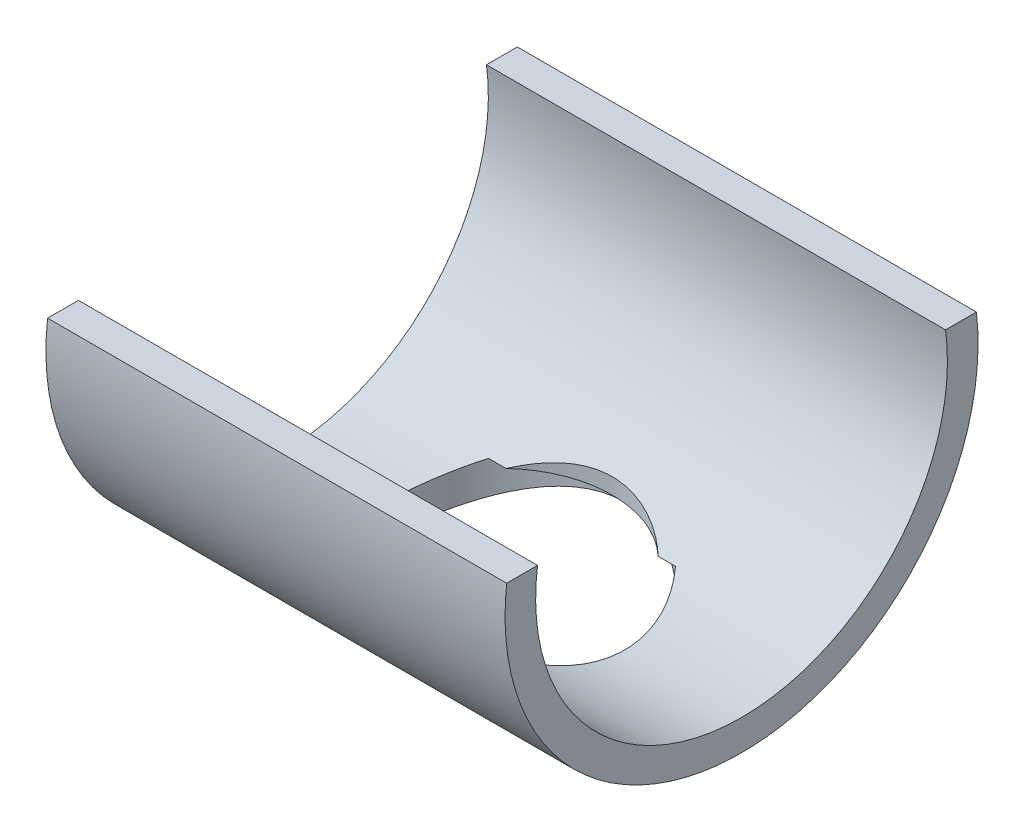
ISO-10303-21;
HEADER;
FILE_DESCRIPTION(('STEP AP214'),'2;1');
FILE_NAME('part.step','',(''),(''),'','','');
FILE_SCHEMA(('AUTOMOTIVE_DESIGN { 1 0 10303 214 1 1 1 1 }'));
ENDSEC;
DATA;
#1=APPLICATION_CONTEXT('core data for automotive mechanical design processes');
#2=APPLICATION_PROTOCOL_DEFINITION('international standard','automotive_design',2000,#1);
#3=PRODUCT_CONTEXT('',#1,'mechanical');
#4=PRODUCT('Part','Part','',(#3));
#5=PRODUCT_RELATED_PRODUCT_CATEGORY('part','',(#4));
#6=PRODUCT_DEFINITION_FORMATION('','',#4);
#7=PRODUCT_DEFINITION_CONTEXT('part definition',#1,'design');
#8=PRODUCT_DEFINITION('design','',#6,#7);
#9=PRODUCT_DEFINITION_SHAPE('','',#8);
#10=(LENGTH_UNIT() NAMED_UNIT(*) SI_UNIT(.MILLI.,.METRE.));
#11=(NAMED_UNIT(*) PLANE_ANGLE_UNIT() SI_UNIT($,.RADIAN.));
#12=(NAMED_UNIT(*) SI_UNIT($,.STERADIAN.) SOLID_ANGLE_UNIT());
#13=UNCERTAINTY_MEASURE_WITH_UNIT(LENGTH_MEASURE(1.E-05),#10,'distance_accuracy_value','');
#14=(GEOMETRIC_REPRESENTATION_CONTEXT(3) GLOBAL_UNCERTAINTY_ASSIGNED_CONTEXT((#13)) GLOBAL_UNIT_ASSIGNED_CONTEXT((#10,
#11,#12)) REPRESENTATION_CONTEXT('',''));
#15=CARTESIAN_POINT('',(0.,0.,0.));
#16=DIRECTION('',(0.,0.,1.));
#17=DIRECTION('',(1.,0.,0.));
#18=AXIS2_PLACEMENT_3D('',#15,#16,#17);
#19=CARTESIAN_POINT('',(-78.5,0.,0.));
#20=DIRECTION('',(1.,0.,0.));
#21=DIRECTION('',(0.,0.,-1.));
#22=AXIS2_PLACEMENT_3D('',#19,#20,#21);
#23=CYLINDRICAL_SURFACE('',#22,74.);
#24=DIRECTION('',(1.,0.,0.));
#25=VECTOR('',#24,1.);
#26=CARTESIAN_POINT('',(-78.5,10.,73.3212111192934));
#27=LINE('',#26,#25);
#28=CARTESIAN_POINT('',(-78.5,10.,73.3212111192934));
#29=VERTEX_POINT('',#28);
#30=CARTESIAN_POINT('',(86.5,10.,73.3212111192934));
#31=VERTEX_POINT('',#30);
#32=EDGE_CURVE('E186',#29,#31,#27,.T.);
#33=ORIENTED_EDGE('',*,*,#32,.T.);
#34=CARTESIAN_POINT('',(86.5,0.,0.));
#35=DIRECTION('',(-1.,0.,0.));
#36=DIRECTION('',(0.,0.,-1.));
#37=AXIS2_PLACEMENT_3D('',#34,#35,#36);
#38=CIRCLE('',#37,74.);
#39=CARTESIAN_POINT('',(86.5,10.,-73.3212111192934));
#40=VERTEX_POINT('',#39);
#41=EDGE_CURVE('E111',#40,#31,#38,.T.);
#42=ORIENTED_EDGE('',*,*,#41,.F.);
#43=DIRECTION('',(1.,0.,0.));
#44=VECTOR('',#43,1.);
#45=CARTESIAN_POINT('',(-78.5,10.,-73.3212111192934));
#46=LINE('',#45,#44);
#47=CARTESIAN_POINT('',(-78.5,10.,-73.3212111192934));
#48=VERTEX_POINT('',#47);
#49=EDGE_CURVE('E56',#48,#40,#46,.T.);
#50=ORIENTED_EDGE('',*,*,#49,.F.);
#51=CARTESIAN_POINT('',(-78.5,0.,0.));
#52=DIRECTION('',(-1.,0.,0.));
#53=DIRECTION('',(0.,0.,-1.));
#54=AXIS2_PLACEMENT_3D('',#51,#52,#53);
#55=CIRCLE('',#54,74.);
#56=EDGE_CURVE('E175',#48,#29,#55,.T.);
#57=ORIENTED_EDGE('',*,*,#56,.T.);
#58=EDGE_LOOP('',(#33,#42,#50,#57));
#59=FACE_BOUND('',#58,.T.);
#60=DIRECTION('',(1.,0.,0.));
#61=VECTOR('',#60,1.);
#62=CARTESIAN_POINT('',(-78.5,-68.,-29.1890390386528));
#63=LINE('',#62,#61);
#64=CARTESIAN_POINT('',(-33.5894328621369,-68.,-29.1890390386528));
#65=VERTEX_POINT('',#64);
#66=CARTESIAN_POINT('',(-27.3495886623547,-68.,-29.1890390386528));
#67=VERTEX_POINT('',#66);
#68=EDGE_CURVE('E42',#65,#67,#63,.T.);
#69=ORIENTED_EDGE('',*,*,#68,.T.);
#70=CARTESIAN_POINT('',(-27.3495886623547,-68.,-29.1890390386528));
#71=CARTESIAN_POINT('',(-26.5518898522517,-67.6792290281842,-29.9364292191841));
#72=CARTESIAN_POINT('',(-25.7236696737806,-67.3578214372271,-30.6510858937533));
#73=CARTESIAN_POINT('',(-24.0094184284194,-66.7219311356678,-32.0116618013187));
#74=CARTESIAN_POINT('',(-23.1233606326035,-66.4074517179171,-32.6575488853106));
#75=CARTESIAN_POINT('',(-21.2906901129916,-65.7916703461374,-33.8811027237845));
#76=CARTESIAN_POINT('',(-20.3436794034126,-65.4904825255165,-34.458231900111));
#77=CARTESIAN_POINT('',(-18.39922769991,-64.9127875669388,-35.5345330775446));
#78=CARTESIAN_POINT('',(-17.4017927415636,-64.6362774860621,-36.0337143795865));
#79=CARTESIAN_POINT('',(-15.3570255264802,-64.1159658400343,-36.9516255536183));
#80=CARTESIAN_POINT('',(-14.3095051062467,-63.8723033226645,-37.3700164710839));
#81=CARTESIAN_POINT('',(-12.1744966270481,-63.4281379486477,-38.1190400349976));
#82=CARTESIAN_POINT('',(-11.0870075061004,-63.2276362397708,-38.4496703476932));
#83=CARTESIAN_POINT('',(-8.8838849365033,-62.8788129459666,-39.0175063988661));
#84=CARTESIAN_POINT('',(-7.76836690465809,-62.7303061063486,-39.2550441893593));
#85=CARTESIAN_POINT('',(-5.51508109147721,-62.4912974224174,-39.634435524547));
#86=CARTESIAN_POINT('',(-4.37731696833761,-62.4007861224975,-39.7763046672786));
#87=CARTESIAN_POINT('',(-2.21515337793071,-62.2886095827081,-39.951700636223));
#88=CARTESIAN_POINT('',(-1.1918946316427,-62.2605229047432,-39.9953395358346));
#89=CARTESIAN_POINT('',(0.855058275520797,-62.2549920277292,-40.0039513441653));
#90=CARTESIAN_POINT('',(1.87875240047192,-62.277544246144,-39.9689298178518));
#91=CARTESIAN_POINT('',(3.91871065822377,-62.3724079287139,-39.820727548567));
#92=CARTESIAN_POINT('',(4.93496998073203,-62.4447491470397,-39.7075000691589));
#93=CARTESIAN_POINT('',(6.95147385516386,-62.6363747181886,-39.4045246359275));
#94=CARTESIAN_POINT('',(7.95171847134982,-62.755658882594,-39.2147769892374));
#95=CARTESIAN_POINT('',(9.86421277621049,-63.0275012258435,-38.7762287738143));
#96=CARTESIAN_POINT('',(10.7779312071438,-63.1773640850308,-38.5321172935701));
#97=CARTESIAN_POINT('',(12.5803359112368,-63.5096859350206,-37.9818772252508));
#98=CARTESIAN_POINT('',(13.4690229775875,-63.6921438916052,-37.6757506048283));
#99=CARTESIAN_POINT('',(15.2178815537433,-64.0847651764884,-37.0039756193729));
#100=CARTESIAN_POINT('',(16.0780349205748,-64.2949457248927,-36.6382902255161));
#101=CARTESIAN_POINT('',(17.7659297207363,-64.7376623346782,-35.8502333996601));
#102=CARTESIAN_POINT('',(18.5936722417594,-64.9701976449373,-35.4278638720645));
#103=CARTESIAN_POINT('',(20.1274361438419,-65.4265716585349,-34.5770325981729));
#104=CARTESIAN_POINT('',(20.8370166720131,-65.6486873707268,-34.1540378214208));
#105=CARTESIAN_POINT('',(22.2264122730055,-66.1028170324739,-33.266590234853));
#106=CARTESIAN_POINT('',(22.9062285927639,-66.3348305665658,-32.8021391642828));
#107=CARTESIAN_POINT('',(24.2324036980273,-66.8043847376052,-31.8349194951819));
#108=CARTESIAN_POINT('',(24.8788627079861,-67.0419052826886,-31.3322784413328));
#109=CARTESIAN_POINT('',(26.139100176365,-67.5197257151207,-30.2888823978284));
#110=CARTESIAN_POINT('',(26.7528807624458,-67.7600254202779,-29.7481298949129));
#111=CARTESIAN_POINT('',(27.3495886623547,-68.,-29.1890390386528));
#112=B_SPLINE_CURVE_WITH_KNOTS('',3,(#70,#71,#72,#73,#74,#75,#76,#77,#78,#79,#80,#81,#82,#83,
#84,#85,#86,#87,#88,#89,#90,#91,#92,#93,#94,#95,#96,#97,#98,#99,#100,#101,#102,#103,#104,#105,
#106,#107,#108,#109,#110,#111),.UNSPECIFIED.,.F.,.F.,(4,2,2,2,2,2,2,2,2,2,2,2,2,2,2,2,2,2,2,2,
4),(0.,3.41688980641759,6.8353700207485,10.279031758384,13.7222822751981,17.1796791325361,
20.6371679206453,24.0822094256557,27.5266891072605,30.5962405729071,33.6655748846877,
36.7367450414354,39.8079028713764,42.6776416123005,45.547289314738,48.4187279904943,
51.2900702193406,53.8547926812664,56.4194075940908,58.9758050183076,61.5320357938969),.UNSPECIFIED.);
#113=CARTESIAN_POINT('',(27.3495886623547,-68.,-29.1890390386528));
#114=VERTEX_POINT('',#113);
#115=EDGE_CURVE('E11',#67,#114,#112,.T.);
#116=ORIENTED_EDGE('',*,*,#115,.T.);
#117=CARTESIAN_POINT('',(33.5894328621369,-68.,-29.1890390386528));
#118=VERTEX_POINT('',#117);
#119=EDGE_CURVE('E117',#114,#118,#63,.T.);
#120=ORIENTED_EDGE('',*,*,#119,.T.);
#121=CARTESIAN_POINT('',(33.5894328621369,-68.,-29.1890390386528));
#122=CARTESIAN_POINT('',(33.9730123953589,-68.1894792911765,-28.7476229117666));
#123=CARTESIAN_POINT('',(34.348221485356,-68.3772661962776,-28.2982833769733));
#124=CARTESIAN_POINT('',(35.0814600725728,-68.7485179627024,-27.3840236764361));
#125=CARTESIAN_POINT('',(35.4394885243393,-68.931982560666,-26.9191025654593));
#126=CARTESIAN_POINT('',(36.4873666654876,-69.4746028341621,-25.5010552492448));
#127=CARTESIAN_POINT('',(37.1506894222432,-69.8258258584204,-24.5250125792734));
#128=CARTESIAN_POINT('',(38.404813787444,-70.5010570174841,-22.5107820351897));
#129=CARTESIAN_POINT('',(38.995216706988,-70.8249127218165,-21.4722950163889));
#130=CARTESIAN_POINT('',(40.0942182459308,-71.4358995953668,-19.3426688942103));
#131=CARTESIAN_POINT('',(40.6028321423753,-71.7230376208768,-18.251539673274));
#132=CARTESIAN_POINT('',(41.5350547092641,-72.2548511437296,-16.0175071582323));
#133=CARTESIAN_POINT('',(41.9582775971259,-72.4993332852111,-14.8743962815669));
#134=CARTESIAN_POINT('',(42.7116372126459,-72.9379194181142,-12.5483228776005));
#135=CARTESIAN_POINT('',(43.0417688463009,-73.1320206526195,-11.3653581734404));
#136=CARTESIAN_POINT('',(43.6034636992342,-73.4640104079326,-8.97189062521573));
#137=CARTESIAN_POINT('',(43.8352909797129,-73.6020494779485,-7.76147087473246));
#138=CARTESIAN_POINT('',(44.1980260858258,-73.8186577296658,-5.32039009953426));
#139=CARTESIAN_POINT('',(44.3289458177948,-73.8972339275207,-4.08973148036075));
#140=CARTESIAN_POINT('',(44.4804018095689,-73.9881952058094,-1.73373745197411));
#141=CARTESIAN_POINT('',(44.5100256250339,-74.0060290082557,-0.609185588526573));
#142=CARTESIAN_POINT('',(44.4840215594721,-73.9903913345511,1.63853768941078));
#143=CARTESIAN_POINT('',(44.4283987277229,-73.9569228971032,2.76170918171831));
#144=CARTESIAN_POINT('',(44.2326367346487,-73.8394884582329,4.99849643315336));
#145=CARTESIAN_POINT('',(44.0924576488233,-73.7554986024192,6.1121074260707));
#146=CARTESIAN_POINT('',(43.7294470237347,-73.5390598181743,8.32094698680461));
#147=CARTESIAN_POINT('',(43.5066162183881,-73.4066113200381,9.41617571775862));
#148=CARTESIAN_POINT('',(42.991184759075,-73.1023286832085,11.5393060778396));
#149=CARTESIAN_POINT('',(42.7015744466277,-72.932192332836,12.5681814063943));
#150=CARTESIAN_POINT('',(42.051620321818,-72.5535596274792,14.5960593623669));
#151=CARTESIAN_POINT('',(41.6912755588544,-72.3450627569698,15.5950615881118));
#152=CARTESIAN_POINT('',(40.9032097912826,-71.8937982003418,17.5583845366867));
#153=CARTESIAN_POINT('',(40.4754696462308,-71.6510207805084,18.5226953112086));
#154=CARTESIAN_POINT('',(39.5562965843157,-71.1358259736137,20.4120757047));
#155=CARTESIAN_POINT('',(39.0648723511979,-70.8634126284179,21.3371506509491));
#156=CARTESIAN_POINT('',(38.1840951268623,-70.3824171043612,22.863551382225));
#157=CARTESIAN_POINT('',(37.8105091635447,-70.1803212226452,23.4761135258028));
#158=CARTESIAN_POINT('',(37.0359116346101,-69.7660495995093,24.6800210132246));
#159=CARTESIAN_POINT('',(36.6349039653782,-69.5538752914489,25.271369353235));
#160=CARTESIAN_POINT('',(35.8077652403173,-69.1217906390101,26.4302716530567));
#161=CARTESIAN_POINT('',(35.3817154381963,-68.9019061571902,26.997893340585));
#162=CARTESIAN_POINT('',(34.5043105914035,-68.4554985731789,28.1105757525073));
#163=CARTESIAN_POINT('',(34.0529542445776,-68.2289751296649,28.6556353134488));
#164=CARTESIAN_POINT('',(33.5894328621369,-68.,29.1890390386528));
#165=B_SPLINE_CURVE_WITH_KNOTS('',3,(#121,#122,#123,#124,#125,#126,#127,#128,#129,#130,#131,
#132,#133,#134,#135,#136,#137,#138,#139,#140,#141,#142,#143,#144,#145,#146,#147,#148,#149,#150,
#151,#152,#153,#154,#155,#156,#157,#158,#159,#160,#161,#162,#163,#164),.UNSPECIFIED.,.F.,.F.,(4,
2,2,2,2,2,2,2,2,2,2,2,2,2,2,2,2,2,2,2,2,4),(0.,1.84394060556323,3.68799327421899,
7.37763184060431,11.0866256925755,14.7949259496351,18.5196219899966,22.2445218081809,
25.9593515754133,29.6737429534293,33.0446709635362,36.4153993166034,39.7877204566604,
43.1600116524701,46.4034825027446,49.6469969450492,52.8914342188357,56.1354295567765,
58.3708588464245,60.6059711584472,62.8341936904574,65.0625309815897),.UNSPECIFIED.);
#166=CARTESIAN_POINT('',(33.5894328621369,-68.,29.1890390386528));
#167=VERTEX_POINT('',#166);
#168=EDGE_CURVE('E101',#118,#167,#165,.T.);
#169=ORIENTED_EDGE('',*,*,#168,.T.);
#170=DIRECTION('',(1.,0.,0.));
#171=VECTOR('',#170,1.);
#172=CARTESIAN_POINT('',(-78.5,-68.,29.1890390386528));
#173=LINE('',#172,#171);
#174=CARTESIAN_POINT('',(27.3495886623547,-68.,29.1890390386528));
#175=VERTEX_POINT('',#174);
#176=EDGE_CURVE('E121',#167,#175,#173,.F.);
#177=ORIENTED_EDGE('',*,*,#176,.T.);
#178=CARTESIAN_POINT('',(27.3495886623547,-68.,29.1890390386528));
#179=CARTESIAN_POINT('',(26.5518898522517,-67.6792290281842,29.9364292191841));
#180=CARTESIAN_POINT('',(25.7236696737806,-67.3578214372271,30.6510858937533));
#181=CARTESIAN_POINT('',(24.0094184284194,-66.7219311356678,32.0116618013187));
#182=CARTESIAN_POINT('',(23.1233606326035,-66.4074517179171,32.6575488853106));
#183=CARTESIAN_POINT('',(21.2906901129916,-65.7916703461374,33.8811027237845));
#184=CARTESIAN_POINT('',(20.3436794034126,-65.4904825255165,34.458231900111));
#185=CARTESIAN_POINT('',(18.39922769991,-64.9127875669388,35.5345330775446));
#186=CARTESIAN_POINT('',(17.4017927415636,-64.6362774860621,36.0337143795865));
#187=CARTESIAN_POINT('',(15.3570255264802,-64.1159658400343,36.9516255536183));
#188=CARTESIAN_POINT('',(14.3095051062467,-63.8723033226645,37.3700164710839));
#189=CARTESIAN_POINT('',(12.1744966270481,-63.4281379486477,38.1190400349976));
#190=CARTESIAN_POINT('',(11.0870075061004,-63.2276362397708,38.4496703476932));
#191=CARTESIAN_POINT('',(8.8838849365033,-62.8788129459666,39.0175063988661));
#192=CARTESIAN_POINT('',(7.76836690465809,-62.7303061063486,39.2550441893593));
#193=CARTESIAN_POINT('',(5.51508109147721,-62.4912974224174,39.634435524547));
#194=CARTESIAN_POINT('',(4.37731696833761,-62.4007861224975,39.7763046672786));
#195=CARTESIAN_POINT('',(2.21515337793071,-62.2886095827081,39.951700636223));
#196=CARTESIAN_POINT('',(1.1918946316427,-62.2605229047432,39.9953395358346));
#197=CARTESIAN_POINT('',(-0.855058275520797,-62.2549920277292,40.0039513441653));
#198=CARTESIAN_POINT('',(-1.87875240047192,-62.277544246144,39.9689298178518));
#199=CARTESIAN_POINT('',(-3.91871065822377,-62.3724079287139,39.820727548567));
#200=CARTESIAN_POINT('',(-4.93496998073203,-62.4447491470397,39.7075000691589));
#201=CARTESIAN_POINT('',(-6.95147385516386,-62.6363747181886,39.4045246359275));
#202=CARTESIAN_POINT('',(-7.95171847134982,-62.755658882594,39.2147769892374));
#203=CARTESIAN_POINT('',(-9.86421277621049,-63.0275012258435,38.7762287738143));
#204=CARTESIAN_POINT('',(-10.7779312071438,-63.1773640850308,38.5321172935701));
#205=CARTESIAN_POINT('',(-12.5803359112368,-63.5096859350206,37.9818772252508));
#206=CARTESIAN_POINT('',(-13.4690229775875,-63.6921438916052,37.6757506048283));
#207=CARTESIAN_POINT('',(-15.2178815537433,-64.0847651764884,37.0039756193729));
#208=CARTESIAN_POINT('',(-16.0780349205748,-64.2949457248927,36.6382902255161));
#209=CARTESIAN_POINT('',(-17.7659297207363,-64.7376623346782,35.8502333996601));
#210=CARTESIAN_POINT('',(-18.5936722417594,-64.9701976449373,35.4278638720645));
#211=CARTESIAN_POINT('',(-20.1274361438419,-65.4265716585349,34.5770325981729));
#212=CARTESIAN_POINT('',(-20.8370166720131,-65.6486873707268,34.1540378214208));
#213=CARTESIAN_POINT('',(-22.2264122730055,-66.1028170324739,33.266590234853));
#214=CARTESIAN_POINT('',(-22.9062285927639,-66.3348305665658,32.8021391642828));
#215=CARTESIAN_POINT('',(-24.2324036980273,-66.8043847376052,31.8349194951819));
#216=CARTESIAN_POINT('',(-24.8788627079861,-67.0419052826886,31.3322784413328));
#217=CARTESIAN_POINT('',(-26.139100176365,-67.5197257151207,30.2888823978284));
#218=CARTESIAN_POINT('',(-26.7528807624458,-67.7600254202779,29.7481298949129));
#219=CARTESIAN_POINT('',(-27.3495886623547,-68.,29.1890390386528));
#220=B_SPLINE_CURVE_WITH_KNOTS('',3,(#178,#179,#180,#181,#182,#183,#184,#185,#186,#187,#188,
#189,#190,#191,#192,#193,#194,#195,#196,#197,#198,#199,#200,#201,#202,#203,#204,#205,#206,#207,
#208,#209,#210,#211,#212,#213,#214,#215,#216,#217,#218,#219),.UNSPECIFIED.,.F.,.F.,(4,2,2,2,2,2,
2,2,2,2,2,2,2,2,2,2,2,2,2,2,4),(0.,3.41688980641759,6.8353700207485,10.279031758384,
13.7222822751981,17.1796791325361,20.6371679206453,24.0822094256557,27.5266891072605,
30.5962405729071,33.6655748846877,36.7367450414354,39.8079028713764,42.6776416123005,
45.547289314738,48.4187279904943,51.2900702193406,53.8547926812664,56.4194075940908,
58.9758050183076,61.5320357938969),.UNSPECIFIED.);
#221=CARTESIAN_POINT('',(-27.3495886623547,-68.,29.1890390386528));
#222=VERTEX_POINT('',#221);
#223=EDGE_CURVE('E126',#175,#222,#220,.T.);
#224=ORIENTED_EDGE('',*,*,#223,.T.);
#225=CARTESIAN_POINT('',(-33.5894328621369,-68.,29.1890390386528));
#226=VERTEX_POINT('',#225);
#227=EDGE_CURVE('E122',#222,#226,#173,.F.);
#228=ORIENTED_EDGE('',*,*,#227,.T.);
#229=CARTESIAN_POINT('',(-33.5894328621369,-68.,29.1890390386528));
#230=CARTESIAN_POINT('',(-33.9730123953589,-68.1894792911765,28.7476229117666));
#231=CARTESIAN_POINT('',(-34.348221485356,-68.3772661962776,28.2982833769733));
#232=CARTESIAN_POINT('',(-35.0814600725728,-68.7485179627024,27.3840236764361));
#233=CARTESIAN_POINT('',(-35.4394885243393,-68.931982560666,26.9191025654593));
#234=CARTESIAN_POINT('',(-36.4873666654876,-69.4746028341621,25.5010552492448));
#235=CARTESIAN_POINT('',(-37.1506894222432,-69.8258258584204,24.5250125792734));
#236=CARTESIAN_POINT('',(-38.404813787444,-70.5010570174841,22.5107820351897));
#237=CARTESIAN_POINT('',(-38.995216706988,-70.8249127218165,21.4722950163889));
#238=CARTESIAN_POINT('',(-40.0942182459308,-71.4358995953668,19.3426688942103));
#239=CARTESIAN_POINT('',(-40.6028321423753,-71.7230376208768,18.251539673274));
#240=CARTESIAN_POINT('',(-41.5350547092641,-72.2548511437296,16.0175071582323));
#241=CARTESIAN_POINT('',(-41.9582775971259,-72.4993332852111,14.8743962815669));
#242=CARTESIAN_POINT('',(-42.7116372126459,-72.9379194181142,12.5483228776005));
#243=CARTESIAN_POINT('',(-43.0417688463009,-73.1320206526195,11.3653581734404));
#244=CARTESIAN_POINT('',(-43.6034636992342,-73.4640104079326,8.97189062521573));
#245=CARTESIAN_POINT('',(-43.8352909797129,-73.6020494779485,7.76147087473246));
#246=CARTESIAN_POINT('',(-44.1980260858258,-73.8186577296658,5.32039009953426));
#247=CARTESIAN_POINT('',(-44.3289458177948,-73.8972339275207,4.08973148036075));
#248=CARTESIAN_POINT('',(-44.4804018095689,-73.9881952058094,1.73373745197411));
#249=CARTESIAN_POINT('',(-44.5100256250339,-74.0060290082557,0.609185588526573));
#250=CARTESIAN_POINT('',(-44.4840215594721,-73.9903913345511,-1.63853768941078));
#251=CARTESIAN_POINT('',(-44.4283987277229,-73.9569228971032,-2.76170918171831));
#252=CARTESIAN_POINT('',(-44.2326367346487,-73.8394884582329,-4.99849643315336));
#253=CARTESIAN_POINT('',(-44.0924576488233,-73.7554986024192,-6.1121074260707));
#254=CARTESIAN_POINT('',(-43.7294470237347,-73.5390598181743,-8.32094698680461));
#255=CARTESIAN_POINT('',(-43.5066162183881,-73.4066113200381,-9.41617571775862));
#256=CARTESIAN_POINT('',(-42.991184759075,-73.1023286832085,-11.5393060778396));
#257=CARTESIAN_POINT('',(-42.7015744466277,-72.932192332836,-12.5681814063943));
#258=CARTESIAN_POINT('',(-42.051620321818,-72.5535596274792,-14.5960593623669));
#259=CARTESIAN_POINT('',(-41.6912755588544,-72.3450627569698,-15.5950615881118));
#260=CARTESIAN_POINT('',(-40.9032097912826,-71.8937982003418,-17.5583845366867));
#261=CARTESIAN_POINT('',(-40.4754696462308,-71.6510207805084,-18.5226953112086));
#262=CARTESIAN_POINT('',(-39.5562965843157,-71.1358259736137,-20.4120757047));
#263=CARTESIAN_POINT('',(-39.0648723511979,-70.8634126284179,-21.3371506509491));
#264=CARTESIAN_POINT('',(-38.1840951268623,-70.3824171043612,-22.863551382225));
#265=CARTESIAN_POINT('',(-37.8105091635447,-70.1803212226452,-23.4761135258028));
#266=CARTESIAN_POINT('',(-37.0359116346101,-69.7660495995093,-24.6800210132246));
#267=CARTESIAN_POINT('',(-36.6349039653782,-69.5538752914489,-25.271369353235));
#268=CARTESIAN_POINT('',(-35.8077652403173,-69.1217906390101,-26.4302716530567));
#269=CARTESIAN_POINT('',(-35.3817154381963,-68.9019061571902,-26.997893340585));
#270=CARTESIAN_POINT('',(-34.5043105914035,-68.4554985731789,-28.1105757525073));
#271=CARTESIAN_POINT('',(-34.0529542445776,-68.2289751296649,-28.6556353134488));
#272=CARTESIAN_POINT('',(-33.5894328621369,-68.,-29.1890390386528));
#273=B_SPLINE_CURVE_WITH_KNOTS('',3,(#229,#230,#231,#232,#233,#234,#235,#236,#237,#238,#239,
#240,#241,#242,#243,#244,#245,#246,#247,#248,#249,#250,#251,#252,#253,#254,#255,#256,#257,#258,
#259,#260,#261,#262,#263,#264,#265,#266,#267,#268,#269,#270,#271,#272),.UNSPECIFIED.,.F.,.F.,(4,
2,2,2,2,2,2,2,2,2,2,2,2,2,2,2,2,2,2,2,2,4),(0.,1.84394060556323,3.68799327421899,
7.37763184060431,11.0866256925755,14.7949259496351,18.5196219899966,22.2445218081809,
25.9593515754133,29.6737429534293,33.0446709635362,36.4153993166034,39.7877204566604,
43.1600116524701,46.4034825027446,49.6469969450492,52.8914342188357,56.1354295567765,
58.3708588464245,60.6059711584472,62.8341936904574,65.0625309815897),.UNSPECIFIED.);
#274=EDGE_CURVE('E112',#226,#65,#273,.T.);
#275=ORIENTED_EDGE('',*,*,#274,.T.);
#276=EDGE_LOOP('',(#69,#116,#120,#169,#177,#224,#228,#275));
#277=FACE_BOUND('',#276,.T.);
#278=ADVANCED_FACE('F30',(#59,#277),#23,.F.);
#279=CARTESIAN_POINT('',(-78.5,0.,0.));
#280=DIRECTION('',(1.,0.,0.));
#281=DIRECTION('',(0.,0.,-1.));
#282=AXIS2_PLACEMENT_3D('',#279,#280,#281);
#283=CYLINDRICAL_SURFACE('',#282,85.);
#284=DIRECTION('',(1.,0.,0.));
#285=VECTOR('',#284,1.);
#286=CARTESIAN_POINT('',(-78.5,10.,-84.4097150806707));
#287=LINE('',#286,#285);
#288=CARTESIAN_POINT('',(-78.5,10.,-84.4097150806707));
#289=VERTEX_POINT('',#288);
#290=CARTESIAN_POINT('',(86.5,10.,-84.4097150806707));
#291=VERTEX_POINT('',#290);
#292=EDGE_CURVE('E188',#289,#291,#287,.T.);
#293=ORIENTED_EDGE('',*,*,#292,.T.);
#294=CARTESIAN_POINT('',(86.5,0.,0.));
#295=DIRECTION('',(1.,0.,0.));
#296=DIRECTION('',(0.,0.,-1.));
#297=AXIS2_PLACEMENT_3D('',#294,#295,#296);
#298=CIRCLE('',#297,85.);
#299=CARTESIAN_POINT('',(86.5,10.,84.4097150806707));
#300=VERTEX_POINT('',#299);
#301=EDGE_CURVE('E169',#300,#291,#298,.T.);
#302=ORIENTED_EDGE('',*,*,#301,.F.);
#303=DIRECTION('',(1.,0.,0.));
#304=VECTOR('',#303,1.);
#305=CARTESIAN_POINT('',(-78.5,10.,84.4097150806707));
#306=LINE('',#305,#304);
#307=CARTESIAN_POINT('',(-78.5,10.,84.4097150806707));
#308=VERTEX_POINT('',#307);
#309=EDGE_CURVE('E190',#308,#300,#306,.T.);
#310=ORIENTED_EDGE('',*,*,#309,.F.);
#311=CARTESIAN_POINT('',(-78.5,0.,0.));
#312=DIRECTION('',(1.,0.,0.));
#313=DIRECTION('',(0.,0.,-1.));
#314=AXIS2_PLACEMENT_3D('',#311,#312,#313);
#315=CIRCLE('',#314,85.);
#316=EDGE_CURVE('E180',#308,#289,#315,.T.);
#317=ORIENTED_EDGE('',*,*,#316,.T.);
#318=EDGE_LOOP('',(#293,#302,#310,#317));
#319=FACE_BOUND('',#318,.T.);
#320=CARTESIAN_POINT('',(0.,-72.4206462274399,-44.5));
#321=CARTESIAN_POINT('',(-0.575579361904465,-72.4206469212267,-44.4999993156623));
#322=CARTESIAN_POINT('',(-1.15116463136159,-72.4275162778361,-44.4888269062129));
#323=CARTESIAN_POINT('',(-2.30116177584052,-72.4549138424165,-44.4441896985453));
#324=CARTESIAN_POINT('',(-2.875573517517,-72.4754435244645,-44.4107224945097));
#325=CARTESIAN_POINT('',(-4.59560193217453,-72.5572857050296,-44.2769952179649));
#326=CARTESIAN_POINT('',(-5.73790636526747,-72.6388512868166,-44.1434095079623));
#327=CARTESIAN_POINT('',(-8.0057334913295,-72.8530303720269,-43.7890211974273));
#328=CARTESIAN_POINT('',(-9.13122541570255,-72.9857278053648,-43.5680751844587));
#329=CARTESIAN_POINT('',(-11.3556683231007,-73.2972610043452,-43.041896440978));
#330=CARTESIAN_POINT('',(-12.4546213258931,-73.4760932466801,-42.7366701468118));
#331=CARTESIAN_POINT('',(-14.6129892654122,-73.8726614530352,-42.0474350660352));
#332=CARTESIAN_POINT('',(-15.6725959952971,-74.0901666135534,-41.6638917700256));
#333=CARTESIAN_POINT('',(-17.7534673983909,-74.5580816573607,-40.8206418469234));
#334=CARTESIAN_POINT('',(-18.7747314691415,-74.8084920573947,-40.3609340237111));
#335=CARTESIAN_POINT('',(-20.7743935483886,-75.335216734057,-39.3690271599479));
#336=CARTESIAN_POINT('',(-21.7527915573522,-75.611531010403,-38.8368281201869));
#337=CARTESIAN_POINT('',(-23.6629640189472,-76.1830369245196,-37.7034171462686));
#338=CARTESIAN_POINT('',(-24.5947361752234,-76.4782294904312,-37.1022018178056));
#339=CARTESIAN_POINT('',(-26.4908186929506,-77.1079933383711,-35.7763012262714));
#340=CARTESIAN_POINT('',(-27.4503803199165,-77.4437042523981,-35.0453595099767));
#341=CARTESIAN_POINT('',(-29.3059463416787,-78.1206895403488,-33.5091398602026));
#342=CARTESIAN_POINT('',(-30.201947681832,-78.4619641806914,-32.7038583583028));
#343=CARTESIAN_POINT('',(-31.926747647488,-79.1418897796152,-31.022315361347));
#344=CARTESIAN_POINT('',(-32.7555117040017,-79.4805393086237,-30.1460178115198));
#345=CARTESIAN_POINT('',(-34.3410490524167,-80.1469911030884,-28.3266384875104));
#346=CARTESIAN_POINT('',(-35.0978199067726,-80.4747930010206,-27.3835544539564));
#347=CARTESIAN_POINT('',(-36.5893084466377,-81.1359800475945,-25.3607724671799));
#348=CARTESIAN_POINT('',(-37.3180006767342,-81.4679031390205,-24.2761380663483));
#349=CARTESIAN_POINT('',(-38.6806473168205,-82.1010257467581,-22.0402251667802));
#350=CARTESIAN_POINT('',(-39.3145956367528,-82.4022232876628,-20.8889423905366));
#351=CARTESIAN_POINT('',(-40.4810372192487,-82.9650740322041,-18.5275132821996));
#352=CARTESIAN_POINT('',(-41.0135841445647,-83.2267481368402,-17.3173985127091));
#353=CARTESIAN_POINT('',(-41.9712829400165,-83.7028423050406,-14.8464295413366));
#354=CARTESIAN_POINT('',(-42.3964475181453,-83.9172679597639,-13.5855813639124));
#355=CARTESIAN_POINT('',(-43.1053442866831,-84.2777253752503,-11.12178670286));
#356=CARTESIAN_POINT('',(-43.3974271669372,-84.4277433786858,-9.9218237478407));
#357=CARTESIAN_POINT('',(-43.8814110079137,-84.6775362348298,-7.49668384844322));
#358=CARTESIAN_POINT('',(-44.0733166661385,-84.7773134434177,-6.2715080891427));
#359=CARTESIAN_POINT('',(-44.3541941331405,-84.9236726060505,-3.80695083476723));
#360=CARTESIAN_POINT('',(-44.4432241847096,-84.9702846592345,-2.56757777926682));
#361=CARTESIAN_POINT('',(-44.5172406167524,-85.009020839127,-0.0849120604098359));
#362=CARTESIAN_POINT('',(-44.5022341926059,-85.0011487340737,1.1583803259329));
#363=CARTESIAN_POINT('',(-44.3748188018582,-84.9345169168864,3.51958298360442));
#364=CARTESIAN_POINT('',(-44.2718239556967,-84.8806758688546,4.63815562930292));
#365=CARTESIAN_POINT('',(-43.9821307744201,-84.7299385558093,6.86138673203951));
#366=CARTESIAN_POINT('',(-43.7954389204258,-84.6330456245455,7.96604625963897));
#367=CARTESIAN_POINT('',(-43.3404528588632,-84.3985006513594,10.1540079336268));
#368=CARTESIAN_POINT('',(-43.0721559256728,-84.2608472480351,11.2373093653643));
#369=CARTESIAN_POINT('',(-42.4567789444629,-83.9479477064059,13.3757217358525));
#370=CARTESIAN_POINT('',(-42.1096959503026,-83.7727001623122,14.4308316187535));
#371=CARTESIAN_POINT('',(-41.335249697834,-83.3860834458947,16.5197942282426));
#372=CARTESIAN_POINT('',(-40.9069346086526,-83.1742890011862,17.5532146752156));
#373=CARTESIAN_POINT('',(-39.9767042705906,-82.7207472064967,19.579479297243));
#374=CARTESIAN_POINT('',(-39.4747892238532,-82.4789999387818,20.5723235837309));
#375=CARTESIAN_POINT('',(-38.401071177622,-81.9705352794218,22.5130610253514));
#376=CARTESIAN_POINT('',(-37.8292514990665,-81.703811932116,23.4609433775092));
#377=CARTESIAN_POINT('',(-36.6195880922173,-81.1508156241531,25.3075944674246));
#378=CARTESIAN_POINT('',(-35.9817405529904,-80.8645415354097,26.2063603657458));
#379=CARTESIAN_POINT('',(-34.5760261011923,-80.2484459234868,28.0395047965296));
#380=CARTESIAN_POINT('',(-33.8015339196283,-79.917146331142,28.9683125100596));
#381=CARTESIAN_POINT('',(-32.1814102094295,-79.2455029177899,30.7581563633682));
#382=CARTESIAN_POINT('',(-31.3357744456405,-78.9051585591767,31.6191884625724));
#383=CARTESIAN_POINT('',(-29.5768656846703,-78.2232912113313,33.2703351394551));
#384=CARTESIAN_POINT('',(-28.6635363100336,-77.8817674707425,34.0603893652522));
#385=CARTESIAN_POINT('',(-26.7739379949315,-77.2063157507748,35.5649396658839));
#386=CARTESIAN_POINT('',(-25.7976667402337,-76.8723880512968,36.2794329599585));
#387=CARTESIAN_POINT('',(-23.7112263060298,-76.1966339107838,37.6791882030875));
#388=CARTESIAN_POINT('',(-22.59650137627,-75.8560763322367,38.3582940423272));
#389=CARTESIAN_POINT('',(-20.3046853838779,-75.2052086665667,39.6191910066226));
#390=CARTESIAN_POINT('',(-19.1275899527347,-74.8949007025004,40.2009753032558));
#391=CARTESIAN_POINT('',(-16.71887055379,-74.3162541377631,41.2608640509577));
#392=CARTESIAN_POINT('',(-15.4872965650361,-74.0478780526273,41.7390612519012));
#393=CARTESIAN_POINT('',(-12.977121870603,-73.5638529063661,42.5863612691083));
#394=CARTESIAN_POINT('',(-11.6985282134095,-73.3481959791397,42.9554803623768));
#395=CARTESIAN_POINT('',(-9.20968271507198,-72.9943560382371,43.5538157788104));
#396=CARTESIAN_POINT('',(-8.00226049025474,-72.8513197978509,43.7919288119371));
#397=CARTESIAN_POINT('',(-5.56636086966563,-72.6241334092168,44.1676784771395));
#398=CARTESIAN_POINT('',(-4.33788474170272,-72.5399797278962,44.3053211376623));
#399=CARTESIAN_POINT('',(-1.87196337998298,-72.4343704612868,44.4777729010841));
#400=CARTESIAN_POINT('',(-0.634525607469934,-72.4128676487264,44.5126594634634));
#401=CARTESIAN_POINT('',(1.83836475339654,-72.4334275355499,44.4791984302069));
#402=CARTESIAN_POINT('',(3.07381750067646,-72.4754848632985,44.4108595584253));
#403=CARTESIAN_POINT('',(5.37648341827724,-72.6120205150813,44.1872007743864));
#404=CARTESIAN_POINT('',(6.445325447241,-72.6992458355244,44.0438927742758));
#405=CARTESIAN_POINT('',(8.56530343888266,-72.9177826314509,43.6811379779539));
#406=CARTESIAN_POINT('',(9.61644119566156,-73.0490896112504,43.4616989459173));
#407=CARTESIAN_POINT('',(11.6949530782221,-73.3516464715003,42.9490901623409));
#408=CARTESIAN_POINT('',(12.7223203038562,-73.522907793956,42.6558992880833));
#409=CARTESIAN_POINT('',(14.7475728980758,-73.9002757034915,41.9987223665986));
#410=CARTESIAN_POINT('',(15.7454563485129,-74.1063845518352,41.6347317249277));
#411=CARTESIAN_POINT('',(17.7513645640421,-74.5577844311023,40.821106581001));
#412=CARTESIAN_POINT('',(18.7578180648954,-74.8044230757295,40.3683506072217));
#413=CARTESIAN_POINT('',(20.7291428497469,-75.3229231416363,39.3924161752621));
#414=CARTESIAN_POINT('',(21.6940136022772,-75.5947848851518,38.8692368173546));
#415=CARTESIAN_POINT('',(23.5789269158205,-76.1571150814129,37.7555689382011));
#416=CARTESIAN_POINT('',(24.4989513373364,-76.4475909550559,37.1650534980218));
#417=CARTESIAN_POINT('',(26.2905781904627,-77.0404421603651,35.9199907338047));
#418=CARTESIAN_POINT('',(27.1621772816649,-77.3428183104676,35.2654390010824));
#419=CARTESIAN_POINT('',(28.973151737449,-77.9960460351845,33.7986495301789));
#420=CARTESIAN_POINT('',(29.9047773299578,-78.3477256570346,32.9771878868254));
#421=CARTESIAN_POINT('',(31.696619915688,-79.0490091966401,31.2588445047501));
#422=CARTESIAN_POINT('',(32.5568309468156,-79.3986129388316,30.3619564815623));
#423=CARTESIAN_POINT('',(34.2015141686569,-80.087049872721,28.4965463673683));
#424=CARTESIAN_POINT('',(34.9859519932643,-80.4258781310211,27.5279921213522));
#425=CARTESIAN_POINT('',(36.4736200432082,-81.0840919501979,25.5241479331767));
#426=CARTESIAN_POINT('',(37.1768505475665,-81.4034775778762,24.4888582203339));
#427=CARTESIAN_POINT('',(38.5211222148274,-82.025964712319,22.3173276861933));
#428=CARTESIAN_POINT('',(39.1589136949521,-82.328031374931,21.1787719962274));
#429=CARTESIAN_POINT('',(40.3352261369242,-82.8939958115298,18.8422441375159));
#430=CARTESIAN_POINT('',(40.8737428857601,-83.157891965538,17.6442694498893));
#431=CARTESIAN_POINT('',(41.8448894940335,-83.639506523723,15.1982008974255));
#432=CARTESIAN_POINT('',(42.277601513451,-83.8572607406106,13.9501468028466));
#433=CARTESIAN_POINT('',(43.0318831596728,-84.2400568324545,11.4130514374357));
#434=CARTESIAN_POINT('',(43.3534675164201,-84.405105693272,10.1240156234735));
#435=CARTESIAN_POINT('',(43.8551970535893,-84.6639649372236,7.64295881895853));
#436=CARTESIAN_POINT('',(44.0460325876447,-84.7631307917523,6.45364923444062));
#437=CARTESIAN_POINT('',(44.3307453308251,-84.9114249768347,4.06039493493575));
#438=CARTESIAN_POINT('',(44.4246289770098,-84.9605566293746,2.85645119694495));
#439=CARTESIAN_POINT('',(44.5141402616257,-85.0073952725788,0.444355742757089));
#440=CARTESIAN_POINT('',(44.5098030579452,-85.005120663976,-0.763794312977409));
#441=CARTESIAN_POINT('',(44.4030171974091,-84.9492544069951,-3.17452947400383));
#442=CARTESIAN_POINT('',(44.3005721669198,-84.895664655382,-4.37711478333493));
#443=CARTESIAN_POINT('',(44.0105612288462,-84.7447083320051,-6.67513247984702));
#444=CARTESIAN_POINT('',(43.8301175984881,-84.6510099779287,-7.77171583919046));
#445=CARTESIAN_POINT('',(43.3888307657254,-84.4233670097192,-9.94423872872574));
#446=CARTESIAN_POINT('',(43.1279927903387,-84.2894250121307,-11.0201795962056));
#447=CARTESIAN_POINT('',(42.5286083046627,-83.9843201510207,-13.1448093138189));
#448=CARTESIAN_POINT('',(42.1900565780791,-83.8131547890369,-14.1934963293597));
#449=CARTESIAN_POINT('',(41.4384597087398,-83.4373421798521,-16.2576327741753));
#450=CARTESIAN_POINT('',(41.0254110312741,-83.2326933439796,-17.2730806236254));
#451=CARTESIAN_POINT('',(40.1106416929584,-82.7855550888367,-19.3048198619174));
#452=CARTESIAN_POINT('',(39.6060679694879,-82.5418922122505,-20.3195673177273));
#453=CARTESIAN_POINT('',(38.5242934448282,-82.0283158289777,-22.3025704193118));
#454=CARTESIAN_POINT('',(37.9470915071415,-81.7584019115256,-23.2708253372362));
#455=CARTESIAN_POINT('',(36.7238426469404,-81.1978756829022,-25.1569723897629));
#456=CARTESIAN_POINT('',(36.0777724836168,-80.907256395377,-26.0748473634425));
#457=CARTESIAN_POINT('',(34.7207935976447,-80.3113435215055,-27.856247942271));
#458=CARTESIAN_POINT('',(34.0098812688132,-80.0060491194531,-28.7197705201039));
#459=CARTESIAN_POINT('',(32.447001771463,-79.3536448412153,-30.4790217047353));
#460=CARTESIAN_POINT('',(31.5880854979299,-79.0055654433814,-31.3682489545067));
#461=CARTESIAN_POINT('',(30.2470591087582,-78.4822610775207,-32.6457776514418));
#462=CARTESIAN_POINT('',(29.7912388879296,-78.3076156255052,-33.0622642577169));
#463=CARTESIAN_POINT('',(28.8623947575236,-77.9589794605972,-33.8761496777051));
#464=CARTESIAN_POINT('',(28.3893665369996,-77.7849889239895,-34.2735436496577));
#465=CARTESIAN_POINT('',(26.9446117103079,-77.2654757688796,-35.4368130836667));
#466=CARTESIAN_POINT('',(25.9478640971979,-76.9226676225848,-36.1731575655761));
#467=CARTESIAN_POINT('',(23.8924787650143,-76.2538964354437,-37.5624527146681));
#468=CARTESIAN_POINT('',(22.8338437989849,-75.9279326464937,-38.2154070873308));
#469=CARTESIAN_POINT('',(21.1776609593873,-75.4516133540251,-39.1431037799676));
#470=CARTESIAN_POINT('',(20.6006276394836,-75.291556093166,-39.449873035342));
#471=CARTESIAN_POINT('',(19.4318134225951,-74.980185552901,-40.0385139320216));
#472=CARTESIAN_POINT('',(18.8400359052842,-74.8288702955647,-40.3203912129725));
#473=CARTESIAN_POINT('',(17.6423435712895,-74.5363331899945,-40.8586454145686));
#474=CARTESIAN_POINT('',(17.036424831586,-74.3951141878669,-41.1150151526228));
#475=CARTESIAN_POINT('',(15.8115355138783,-74.1242061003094,-41.6014372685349));
#476=CARTESIAN_POINT('',(15.1925643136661,-73.9945175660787,-41.8314883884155));
#477=CARTESIAN_POINT('',(13.9444827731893,-73.7483926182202,-42.2638889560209));
#478=CARTESIAN_POINT('',(13.3154067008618,-73.6319191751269,-42.4663161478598));
#479=CARTESIAN_POINT('',(12.0466045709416,-73.4130794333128,-42.8435214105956));
#480=CARTESIAN_POINT('',(11.4068787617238,-73.3107128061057,-43.0183001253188));
#481=CARTESIAN_POINT('',(10.1184705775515,-73.1213214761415,-43.339440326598));
#482=CARTESIAN_POINT('',(9.46979340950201,-73.0342882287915,-43.4858176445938));
#483=CARTESIAN_POINT('',(8.16470504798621,-72.8765596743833,-43.7496365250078));
#484=CARTESIAN_POINT('',(7.50829511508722,-72.8058617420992,-43.867082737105));
#485=CARTESIAN_POINT('',(6.28415503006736,-72.6906082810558,-44.0577574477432));
#486=CARTESIAN_POINT('',(5.71724938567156,-72.6437552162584,-44.1349161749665));
#487=CARTESIAN_POINT('',(4.5801161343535,-72.5631169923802,-44.267370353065));
#488=CARTESIAN_POINT('',(4.00988950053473,-72.5293281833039,-44.3226719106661));
#489=CARTESIAN_POINT('',(2.86705324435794,-72.4751280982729,-44.4112430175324));
#490=CARTESIAN_POINT('',(2.29444346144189,-72.4547177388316,-44.4445110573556));
#491=CARTESIAN_POINT('',(1.14789128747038,-72.4274746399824,-44.4888928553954));
#492=CARTESIAN_POINT('',(0.573948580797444,-72.4206455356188,-44.5000006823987));
#493=CARTESIAN_POINT('',(0.,-72.4206462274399,-44.5));
#494=B_SPLINE_CURVE_WITH_KNOTS('',3,(#320,#321,#322,#323,#324,#325,#326,#327,#328,#329,#330,
#331,#332,#333,#334,#335,#336,#337,#338,#339,#340,#341,#342,#343,#344,#345,#346,#347,#348,#349,
#350,#351,#352,#353,#354,#355,#356,#357,#358,#359,#360,#361,#362,#363,#364,#365,#366,#367,#368,
#369,#370,#371,#372,#373,#374,#375,#376,#377,#378,#379,#380,#381,#382,#383,#384,#385,#386,#387,
#388,#389,#390,#391,#392,#393,#394,#395,#396,#397,#398,#399,#400,#401,#402,#403,#404,#405,#406,
#407,#408,#409,#410,#411,#412,#413,#414,#415,#416,#417,#418,#419,#420,#421,#422,#423,#424,#425,
#426,#427,#428,#429,#430,#431,#432,#433,#434,#435,#436,#437,#438,#439,#440,#441,#442,#443,#444,
#445,#446,#447,#448,#449,#450,#451,#452,#453,#454,#455,#456,#457,#458,#459,#460,#461,#462,#463,
#464,#465,#466,#467,#468,#469,#470,#471,#472,#473,#474,#475,#476,#477,#478,#479,#480,#481,#482,
#483,#484,#485,#486,#487,#488,#489,#490,#491,#492,#493),.UNSPECIFIED.,.T.,.F.,(4,2,2,2,2,2,2,2,
2,2,2,2,2,2,2,2,2,2,2,2,2,2,2,2,2,2,2,2,2,2,2,2,2,2,2,2,2,2,2,2,2,2,2,2,2,2,2,2,2,2,2,2,2,2,2,2,
2,2,2,2,2,2,2,2,2,2,2,2,2,2,2,2,2,2,2,2,2,2,2,2,2,2,2,2,2,2,4),(0.,1.7265795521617,
3.45334544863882,6.90719236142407,10.3667328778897,13.8260092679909,17.2652939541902,
20.7046326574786,24.1439713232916,27.5834792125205,31.335824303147,35.0883496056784,
38.8427921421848,42.5973617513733,46.636683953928,50.6762656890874,54.7137036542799,
58.7506635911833,62.4777755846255,66.2047127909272,69.9295389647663,73.6541075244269,
77.0238967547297,80.3934250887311,83.763065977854,87.1328328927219,90.5448423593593,
93.9568424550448,97.3696582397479,100.782671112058,104.540383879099,108.298320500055,
112.059422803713,115.820663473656,119.862470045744,123.904560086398,127.943015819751,
131.980868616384,135.692341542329,139.40359175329,143.112043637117,146.820182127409,
150.062257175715,153.304001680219,156.546675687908,159.78956019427,163.17865544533,
166.567793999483,169.958292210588,173.349024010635,177.21742903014,181.086156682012,
184.956630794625,188.827091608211,192.840283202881,196.853645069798,200.863880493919,
204.873584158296,208.494521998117,212.115219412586,215.734620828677,219.353888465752,
222.695887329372,226.037668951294,229.379674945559,232.721839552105,236.19572038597,
239.669655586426,243.14476686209,246.620071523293,250.468618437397,252.393180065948,
254.318227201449,258.171110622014,262.023822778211,264.041723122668,266.059165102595,
268.077173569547,270.095278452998,272.107581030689,274.119836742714,276.13096754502,
278.14177491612,279.863365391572,281.584474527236,283.305701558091,285.027389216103),.UNSPECIFIED.);
#495=CARTESIAN_POINT('',(0.,-72.4206462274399,-44.5));
#496=VERTEX_POINT('',#495);
#497=EDGE_CURVE('E132',#496,#496,#494,.T.);
#498=ORIENTED_EDGE('',*,*,#497,.T.);
#499=EDGE_LOOP('',(#498));
#500=FACE_BOUND('',#499,.T.);
#501=ADVANCED_FACE('F205',(#319,#500),#283,.T.);
#502=CARTESIAN_POINT('',(-78.5,10.,-73.3212111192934));
#503=DIRECTION('',(0.,1.,0.));
#504=DIRECTION('',(0.,0.,1.));
#505=AXIS2_PLACEMENT_3D('',#502,#503,#504);
#506=PLANE('',#505);
#507=ORIENTED_EDGE('',*,*,#49,.T.);
#508=DIRECTION('',(0.,0.,1.));
#509=VECTOR('',#508,1.);
#510=CARTESIAN_POINT('',(86.5,10.,-73.3212111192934));
#511=LINE('',#510,#509);
#512=EDGE_CURVE('E172',#291,#40,#511,.T.);
#513=ORIENTED_EDGE('',*,*,#512,.F.);
#514=ORIENTED_EDGE('',*,*,#292,.F.);
#515=DIRECTION('',(0.,0.,1.));
#516=VECTOR('',#515,1.);
#517=CARTESIAN_POINT('',(-78.5,10.,-73.3212111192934));
#518=LINE('',#517,#516);
#519=EDGE_CURVE('E183',#289,#48,#518,.T.);
#520=ORIENTED_EDGE('',*,*,#519,.T.);
#521=EDGE_LOOP('',(#507,#513,#514,#520));
#522=FACE_BOUND('',#521,.T.);
#523=ADVANCED_FACE('F199',(#522),#506,.T.);
#524=CARTESIAN_POINT('',(-78.5,10.,84.4097150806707));
#525=DIRECTION('',(0.,1.,0.));
#526=DIRECTION('',(0.,0.,1.));
#527=AXIS2_PLACEMENT_3D('',#524,#525,#526);
#528=PLANE('',#527);
#529=ORIENTED_EDGE('',*,*,#309,.T.);
#530=DIRECTION('',(0.,0.,1.));
#531=VECTOR('',#530,1.);
#532=CARTESIAN_POINT('',(86.5,10.,84.4097150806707));
#533=LINE('',#532,#531);
#534=EDGE_CURVE('E166',#31,#300,#533,.T.);
#535=ORIENTED_EDGE('',*,*,#534,.F.);
#536=ORIENTED_EDGE('',*,*,#32,.F.);
#537=DIRECTION('',(0.,0.,1.));
#538=VECTOR('',#537,1.);
#539=CARTESIAN_POINT('',(-78.5,10.,84.4097150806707));
#540=LINE('',#539,#538);
#541=EDGE_CURVE('E177',#29,#308,#540,.T.);
#542=ORIENTED_EDGE('',*,*,#541,.T.);
#543=EDGE_LOOP('',(#529,#535,#536,#542));
#544=FACE_BOUND('',#543,.T.);
#545=ADVANCED_FACE('F194',(#544),#528,.T.);
#546=CARTESIAN_POINT('',(-78.5,0.,0.));
#547=DIRECTION('',(1.,0.,0.));
#548=DIRECTION('',(0.,0.,-1.));
#549=AXIS2_PLACEMENT_3D('',#546,#547,#548);
#550=PLANE('',#549);
#551=ORIENTED_EDGE('',*,*,#56,.F.);
#552=ORIENTED_EDGE('',*,*,#519,.F.);
#553=ORIENTED_EDGE('',*,*,#316,.F.);
#554=ORIENTED_EDGE('',*,*,#541,.F.);
#555=EDGE_LOOP('',(#551,#552,#553,#554));
#556=FACE_BOUND('',#555,.T.);
#557=ADVANCED_FACE('F203',(#556),#550,.F.);
#558=CARTESIAN_POINT('',(86.5,0.,0.));
#559=DIRECTION('',(1.,0.,0.));
#560=DIRECTION('',(0.,0.,-1.));
#561=AXIS2_PLACEMENT_3D('',#558,#559,#560);
#562=PLANE('',#561);
#563=ORIENTED_EDGE('',*,*,#41,.T.);
#564=ORIENTED_EDGE('',*,*,#534,.T.);
#565=ORIENTED_EDGE('',*,*,#301,.T.);
#566=ORIENTED_EDGE('',*,*,#512,.T.);
#567=EDGE_LOOP('',(#563,#564,#565,#566));
#568=FACE_BOUND('',#567,.T.);
#569=ADVANCED_FACE('F151',(#568),#562,.T.);
#570=CARTESIAN_POINT('',(-44.5,-68.,0.));
#571=DIRECTION('',(0.,-1.,0.));
#572=DIRECTION('',(0.,0.,-1.));
#573=AXIS2_PLACEMENT_3D('',#570,#571,#572);
#574=PLANE('',#573);
#575=CARTESIAN_POINT('',(0.,-68.,0.));
#576=DIRECTION('',(0.,-1.,0.));
#577=DIRECTION('',(0.,0.,-1.));
#578=AXIS2_PLACEMENT_3D('',#575,#576,#577);
#579=CIRCLE('',#578,44.5);
#580=EDGE_CURVE('E104',#65,#118,#579,.T.);
#581=ORIENTED_EDGE('',*,*,#580,.T.);
#582=ORIENTED_EDGE('',*,*,#119,.F.);
#583=CARTESIAN_POINT('',(0.,-68.,0.));
#584=DIRECTION('',(0.,-1.,0.));
#585=DIRECTION('',(0.,0.,-1.));
#586=AXIS2_PLACEMENT_3D('',#583,#584,#585);
#587=CIRCLE('',#586,40.);
#588=EDGE_CURVE('E232',#67,#114,#587,.T.);
#589=ORIENTED_EDGE('',*,*,#588,.F.);
#590=ORIENTED_EDGE('',*,*,#68,.F.);
#591=EDGE_LOOP('',(#581,#582,#589,#590));
#592=FACE_BOUND('',#591,.T.);
#593=ADVANCED_FACE('F115',(#592),#574,.T.);
#594=CARTESIAN_POINT('',(0.,-107.741237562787,0.));
#595=DIRECTION('',(0.,-1.,0.));
#596=DIRECTION('',(0.,0.,-1.));
#597=AXIS2_PLACEMENT_3D('',#594,#595,#596);
#598=CYLINDRICAL_SURFACE('',#597,40.);
#599=ORIENTED_EDGE('',*,*,#588,.T.);
#600=ORIENTED_EDGE('',*,*,#115,.F.);
#601=EDGE_LOOP('',(#599,#600));
#602=FACE_BOUND('',#601,.T.);
#603=ADVANCED_FACE('F143',(#602),#598,.F.);
#604=CARTESIAN_POINT('',(0.,-107.741237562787,0.));
#605=DIRECTION('',(0.,-1.,0.));
#606=DIRECTION('',(0.,0.,-1.));
#607=AXIS2_PLACEMENT_3D('',#604,#605,#606);
#608=CYLINDRICAL_SURFACE('',#607,44.5);
#609=ORIENTED_EDGE('',*,*,#497,.F.);
#610=EDGE_LOOP('',(#609));
#611=FACE_BOUND('',#610,.T.);
#612=ORIENTED_EDGE('',*,*,#580,.F.);
#613=ORIENTED_EDGE('',*,*,#274,.F.);
#614=EDGE_CURVE('E107',#167,#226,#579,.T.);
#615=ORIENTED_EDGE('',*,*,#614,.F.);
#616=ORIENTED_EDGE('',*,*,#168,.F.);
#617=EDGE_LOOP('',(#612,#613,#615,#616));
#618=FACE_BOUND('',#617,.T.);
#619=ADVANCED_FACE('F103',(#611,#618),#608,.F.);
#620=ORIENTED_EDGE('',*,*,#614,.T.);
#621=ORIENTED_EDGE('',*,*,#227,.F.);
#622=EDGE_CURVE('E48',#175,#222,#587,.T.);
#623=ORIENTED_EDGE('',*,*,#622,.F.);
#624=ORIENTED_EDGE('',*,*,#176,.F.);
#625=EDGE_LOOP('',(#620,#621,#623,#624));
#626=FACE_BOUND('',#625,.T.);
#627=ADVANCED_FACE('F142',(#626),#574,.T.);
#628=ORIENTED_EDGE('',*,*,#622,.T.);
#629=ORIENTED_EDGE('',*,*,#223,.F.);
#630=EDGE_LOOP('',(#628,#629));
#631=FACE_BOUND('',#630,.T.);
#632=ADVANCED_FACE('F138',(#631),#598,.F.);
#633=CLOSED_SHELL('',(#278,#501,#523,#545,#557,#569,#593,#603,#619,#627,#632));
#634=MANIFOLD_SOLID_BREP('B2',#633);
#635=ADVANCED_BREP_SHAPE_REPRESENTATION('',(#18,#634),#14);
#636=SHAPE_DEFINITION_REPRESENTATION(#9,#635);
ENDSEC;
END-ISO-10303-21;
